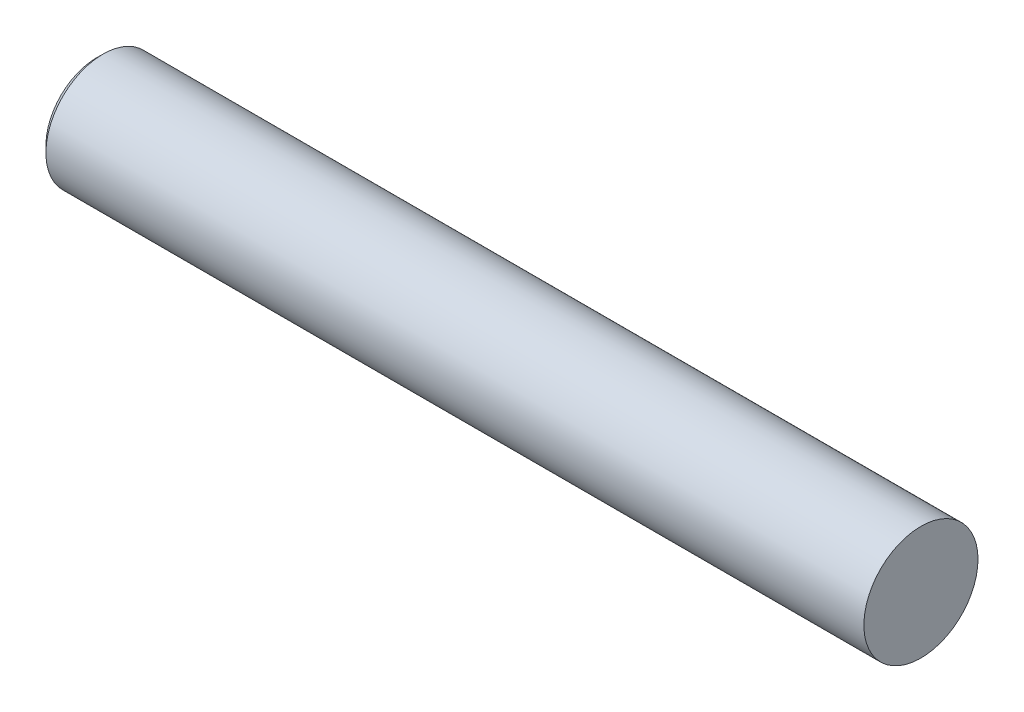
ISO-10303-21;
HEADER;
FILE_DESCRIPTION(('STEP AP214'),'2;1');
FILE_NAME('part.step','',(''),(''),'','','');
FILE_SCHEMA(('AUTOMOTIVE_DESIGN { 1 0 10303 214 1 1 1 1 }'));
ENDSEC;
DATA;
#1=APPLICATION_CONTEXT('core data for automotive mechanical design processes');
#2=APPLICATION_PROTOCOL_DEFINITION('international standard','automotive_design',2000,#1);
#3=PRODUCT_CONTEXT('',#1,'mechanical');
#4=PRODUCT('Part','Part','',(#3));
#5=PRODUCT_RELATED_PRODUCT_CATEGORY('part','',(#4));
#6=PRODUCT_DEFINITION_FORMATION('','',#4);
#7=PRODUCT_DEFINITION_CONTEXT('part definition',#1,'design');
#8=PRODUCT_DEFINITION('design','',#6,#7);
#9=PRODUCT_DEFINITION_SHAPE('','',#8);
#10=(LENGTH_UNIT() NAMED_UNIT(*) SI_UNIT(.MILLI.,.METRE.));
#11=(NAMED_UNIT(*) PLANE_ANGLE_UNIT() SI_UNIT($,.RADIAN.));
#12=(NAMED_UNIT(*) SI_UNIT($,.STERADIAN.) SOLID_ANGLE_UNIT());
#13=UNCERTAINTY_MEASURE_WITH_UNIT(LENGTH_MEASURE(1.E-05),#10,'distance_accuracy_value','');
#14=(GEOMETRIC_REPRESENTATION_CONTEXT(3) GLOBAL_UNCERTAINTY_ASSIGNED_CONTEXT((#13)) GLOBAL_UNIT_ASSIGNED_CONTEXT((#10,
#11,#12)) REPRESENTATION_CONTEXT('',''));
#15=CARTESIAN_POINT('',(0.,0.,0.));
#16=DIRECTION('',(0.,0.,1.));
#17=DIRECTION('',(1.,0.,0.));
#18=AXIS2_PLACEMENT_3D('',#15,#16,#17);
#19=CARTESIAN_POINT('',(130.,0.,0.));
#20=DIRECTION('',(-1.,0.,0.));
#21=DIRECTION('',(0.,0.,1.));
#22=AXIS2_PLACEMENT_3D('',#19,#20,#21);
#23=CYLINDRICAL_SURFACE('',#22,9.);
#24=CARTESIAN_POINT('',(1.,0.,0.));
#25=DIRECTION('',(1.,0.,0.));
#26=DIRECTION('',(0.,0.,-1.));
#27=AXIS2_PLACEMENT_3D('',#24,#25,#26);
#28=CIRCLE('',#27,9.);
#29=CARTESIAN_POINT('',(1.,0.,-9.));
#30=VERTEX_POINT('',#29);
#31=EDGE_CURVE('E37',#30,#30,#28,.T.);
#32=ORIENTED_EDGE('',*,*,#31,.T.);
#33=EDGE_LOOP('',(#32));
#34=FACE_BOUND('',#33,.T.);
#35=CARTESIAN_POINT('',(130.,0.,0.));
#36=DIRECTION('',(1.,0.,0.));
#37=DIRECTION('',(0.,0.,-1.));
#38=AXIS2_PLACEMENT_3D('',#35,#36,#37);
#39=CIRCLE('',#38,9.);
#40=CARTESIAN_POINT('',(130.,0.,-9.));
#41=VERTEX_POINT('',#40);
#42=EDGE_CURVE('E41',#41,#41,#39,.T.);
#43=ORIENTED_EDGE('',*,*,#42,.F.);
#44=EDGE_LOOP('',(#43));
#45=FACE_BOUND('',#44,.T.);
#46=ADVANCED_FACE('F30',(#34,#45),#23,.T.);
#47=CARTESIAN_POINT('',(130.,0.,0.));
#48=DIRECTION('',(1.,0.,0.));
#49=DIRECTION('',(0.,0.,-1.));
#50=AXIS2_PLACEMENT_3D('',#47,#48,#49);
#51=PLANE('',#50);
#52=ORIENTED_EDGE('',*,*,#42,.T.);
#53=EDGE_LOOP('',(#52));
#54=FACE_BOUND('',#53,.T.);
#55=ADVANCED_FACE('F48',(#54),#51,.T.);
#56=CARTESIAN_POINT('',(0.,0.,0.));
#57=DIRECTION('',(1.,0.,0.));
#58=DIRECTION('',(0.,0.,-1.));
#59=AXIS2_PLACEMENT_3D('',#56,#57,#58);
#60=PLANE('',#59);
#61=CARTESIAN_POINT('',(0.,0.,0.));
#62=DIRECTION('',(1.,0.,0.));
#63=DIRECTION('',(0.,0.,-1.));
#64=AXIS2_PLACEMENT_3D('',#61,#62,#63);
#65=CIRCLE('',#64,7.99999999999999);
#66=CARTESIAN_POINT('',(0.,0.,-7.99999999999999));
#67=VERTEX_POINT('',#66);
#68=EDGE_CURVE('E10',#67,#67,#65,.F.);
#69=ORIENTED_EDGE('',*,*,#68,.T.);
#70=EDGE_LOOP('',(#69));
#71=FACE_BOUND('',#70,.T.);
#72=ADVANCED_FACE('F54',(#71),#60,.F.);
#73=CARTESIAN_POINT('',(1.,0.,0.));
#74=DIRECTION('',(1.,0.,0.));
#75=DIRECTION('',(0.,0.,-1.));
#76=AXIS2_PLACEMENT_3D('',#73,#74,#75);
#77=CONICAL_SURFACE('',#76,9.,0.785398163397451);
#78=ORIENTED_EDGE('',*,*,#68,.F.);
#79=EDGE_LOOP('',(#78));
#80=FACE_BOUND('',#79,.T.);
#81=ORIENTED_EDGE('',*,*,#31,.F.);
#82=EDGE_LOOP('',(#81));
#83=FACE_BOUND('',#82,.T.);
#84=ADVANCED_FACE('F32',(#80,#83),#77,.T.);
#85=CLOSED_SHELL('',(#46,#55,#72,#84));
#86=MANIFOLD_SOLID_BREP('B2',#85);
#87=ADVANCED_BREP_SHAPE_REPRESENTATION('',(#18,#86),#14);
#88=SHAPE_DEFINITION_REPRESENTATION(#9,#87);
ENDSEC;
END-ISO-10303-21;
